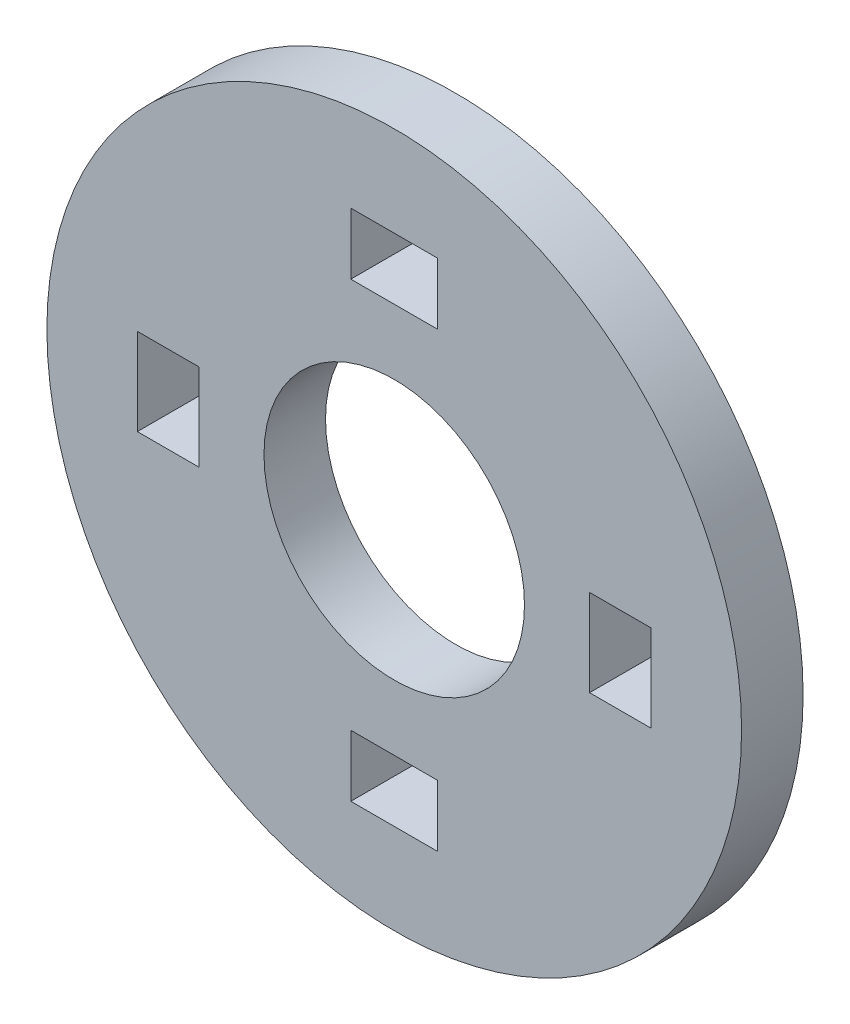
from build123d import *

# Parameters (mm, degrees)
SKETCH1_R           = 25.4
SKETCH1_R_2         = 2.5
BOSS_EXTRUDE1_DEPTH = 4.5
CUT_EXTRUDE1_DEPTH  = 37.201795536
SKETCH3_R           = 9.525
CUT_EXTRUDE2_DEPTH  = 4.5


with BuildPart() as part:
    # Sketch1 → Boss-Extrude1 (new body)
    with BuildSketch(Plane.XY):
        Circle(SKETCH1_R)
        Circle(SKETCH1_R_2, mode=Mode.SUBTRACT)
    extrude(amount=BOSS_EXTRUDE1_DEPTH)

    # Sketch2 → Cut-Extrude1 (cut, through all)
    with BuildSketch(Plane.XY.offset(4.5)):
        with BuildLine():
            Line((-14.283553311, 3.175), (-17.171437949, 3.175))
            ThreePointArc((-17.171437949, 3.175), (-17.4625, 0), (-17.171437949, -3.175))
            Line((-17.171437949, -3.175), (-14.283553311, -3.175))
            Line((-14.283553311, -3.175), (-14.283553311, 3.175))
        make_face()
        with BuildLine():
            Line((-17.171437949, 3.175), (-18.783553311, 3.175))
            Line((-18.783553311, 3.175), (-18.783553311, -3.175))
            Line((-18.783553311, -3.175), (-17.171437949, -3.175))
            ThreePointArc((-17.171437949, -3.175), (-17.4625, 0), (-17.171437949, 3.175))
        make_face()
        with BuildLine():
            Line((3.175, 18.783553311), (0, 18.783553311))
            Line((0, 18.783553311), (0, 17.4625))
            ThreePointArc((0, 17.4625), (1.594156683, 17.389582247), (3.175, 17.171437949))
            Line((3.175, 17.171437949), (3.175, 18.783553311))
        make_face()
        with BuildLine():
            Line((0, 17.4625), (0, 18.783553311))
            Line((0, 18.783553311), (-3.175, 18.783553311))
            Line((-3.175, 18.783553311), (-3.175, 17.171437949))
            ThreePointArc((-3.175, 17.171437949), (-1.594156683, 17.389582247), (0, 17.4625))
        make_face()
        with BuildLine():
            Line((0, 14.283553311), (0, 17.4625))
            ThreePointArc((0, 17.4625), (-1.594156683, 17.389582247), (-3.175, 17.171437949))
            Line((-3.175, 17.171437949), (-3.175, 14.283553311))
            Line((-3.175, 14.283553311), (0, 14.283553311))
        make_face()
        with BuildLine():
            ThreePointArc((3.175, 17.171437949), (1.594156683, 17.389582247), (0, 17.4625))
            Line((0, 17.4625), (0, 14.283553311))
            Line((0, 14.283553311), (3.175, 14.283553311))
            Line((3.175, 14.283553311), (3.175, 17.171437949))
        make_face()
        with BuildLine():
            ThreePointArc((17.4625, 0), (17.389582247, 1.594156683), (17.171437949, 3.175))
            Line((17.171437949, 3.175), (14.283553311, 3.175))
            Line((14.283553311, 3.175), (14.283553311, -3.175))
            Line((14.283553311, -3.175), (17.171437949, -3.175))
            ThreePointArc((17.171437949, -3.175), (17.389582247, -1.594156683), (17.4625, 0))
        make_face()
        with BuildLine():
            Line((18.783553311, -3.175), (18.783553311, 3.175))
            Line((18.783553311, 3.175), (17.171437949, 3.175))
            ThreePointArc((17.171437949, 3.175), (17.389582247, 1.594156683), (17.4625, 0))
            ThreePointArc((17.4625, 0), (17.389582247, -1.594156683), (17.171437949, -3.175))
            Line((17.171437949, -3.175), (18.783553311, -3.175))
        make_face()
        with BuildLine():
            Line((-3.175, -14.283553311), (-3.175, -17.171437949))
            ThreePointArc((-3.175, -17.171437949), (0, -17.4625), (3.175, -17.171437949))
            Line((3.175, -17.171437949), (3.175, -14.283553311))
            Line((3.175, -14.283553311), (-3.175, -14.283553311))
        make_face()
        with BuildLine():
            Line((-3.175, -17.171437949), (-3.175, -18.783553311))
            Line((-3.175, -18.783553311), (3.175, -18.783553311))
            Line((3.175, -18.783553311), (3.175, -17.171437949))
            ThreePointArc((3.175, -17.171437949), (0, -17.4625), (-3.175, -17.171437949))
        make_face()
    extrude(amount=-CUT_EXTRUDE1_DEPTH, mode=Mode.SUBTRACT)

    # Sketch3 → Cut-Extrude2 (cut)
    with BuildSketch(Plane.XY.offset(4.5)):
        Circle(SKETCH3_R)
    extrude(amount=-CUT_EXTRUDE2_DEPTH, mode=Mode.SUBTRACT)


solid = part.part
